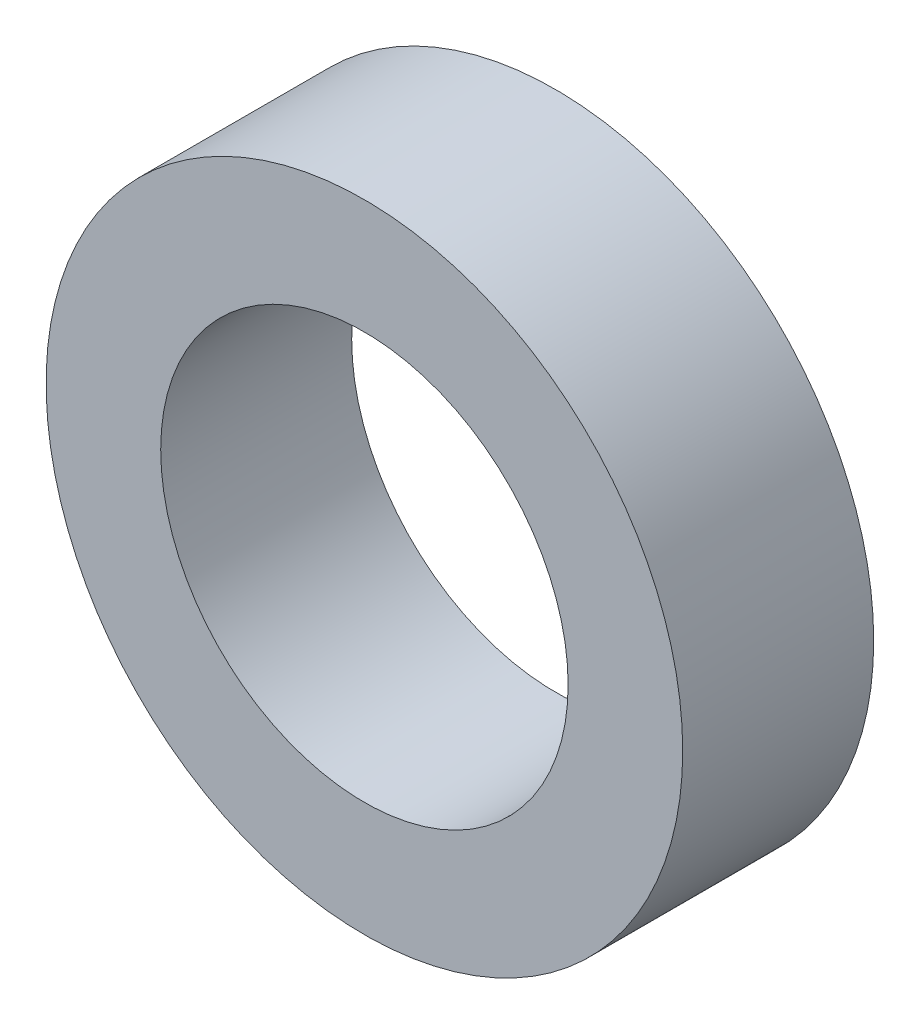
ISO-10303-21;
HEADER;
FILE_DESCRIPTION(('STEP AP214'),'2;1');
FILE_NAME('part.step','',(''),(''),'','','');
FILE_SCHEMA(('AUTOMOTIVE_DESIGN { 1 0 10303 214 1 1 1 1 }'));
ENDSEC;
DATA;
#1=APPLICATION_CONTEXT('core data for automotive mechanical design processes');
#2=APPLICATION_PROTOCOL_DEFINITION('international standard','automotive_design',2000,#1);
#3=PRODUCT_CONTEXT('',#1,'mechanical');
#4=PRODUCT('Part','Part','',(#3));
#5=PRODUCT_RELATED_PRODUCT_CATEGORY('part','',(#4));
#6=PRODUCT_DEFINITION_FORMATION('','',#4);
#7=PRODUCT_DEFINITION_CONTEXT('part definition',#1,'design');
#8=PRODUCT_DEFINITION('design','',#6,#7);
#9=PRODUCT_DEFINITION_SHAPE('','',#8);
#10=(LENGTH_UNIT() NAMED_UNIT(*) SI_UNIT(.MILLI.,.METRE.));
#11=(NAMED_UNIT(*) PLANE_ANGLE_UNIT() SI_UNIT($,.RADIAN.));
#12=(NAMED_UNIT(*) SI_UNIT($,.STERADIAN.) SOLID_ANGLE_UNIT());
#13=UNCERTAINTY_MEASURE_WITH_UNIT(LENGTH_MEASURE(1.E-05),#10,'distance_accuracy_value','');
#14=(GEOMETRIC_REPRESENTATION_CONTEXT(3) GLOBAL_UNCERTAINTY_ASSIGNED_CONTEXT((#13)) GLOBAL_UNIT_ASSIGNED_CONTEXT((#10,
#11,#12)) REPRESENTATION_CONTEXT('',''));
#15=CARTESIAN_POINT('',(0.,0.,0.));
#16=DIRECTION('',(0.,0.,1.));
#17=DIRECTION('',(1.,0.,0.));
#18=AXIS2_PLACEMENT_3D('',#15,#16,#17);
#19=CARTESIAN_POINT('',(0.,0.,3.));
#20=DIRECTION('',(0.,0.,1.));
#21=DIRECTION('',(1.,0.,0.));
#22=AXIS2_PLACEMENT_3D('',#19,#20,#21);
#23=PLANE('',#22);
#24=CARTESIAN_POINT('',(0.,0.,3.));
#25=DIRECTION('',(0.,0.,1.));
#26=DIRECTION('',(1.,0.,0.));
#27=AXIS2_PLACEMENT_3D('',#24,#25,#26);
#28=CIRCLE('',#27,5.);
#29=CARTESIAN_POINT('',(5.,0.,3.));
#30=VERTEX_POINT('',#29);
#31=EDGE_CURVE('E8',#30,#30,#28,.T.);
#32=ORIENTED_EDGE('',*,*,#31,.T.);
#33=EDGE_LOOP('',(#32));
#34=FACE_BOUND('',#33,.T.);
#35=CARTESIAN_POINT('',(0.,0.,3.));
#36=DIRECTION('',(0.,0.,1.));
#37=DIRECTION('',(1.,0.,0.));
#38=AXIS2_PLACEMENT_3D('',#35,#36,#37);
#39=CIRCLE('',#38,3.2);
#40=CARTESIAN_POINT('',(3.2,0.,3.));
#41=VERTEX_POINT('',#40);
#42=EDGE_CURVE('E23',#41,#41,#39,.T.);
#43=ORIENTED_EDGE('',*,*,#42,.F.);
#44=EDGE_LOOP('',(#43));
#45=FACE_BOUND('',#44,.T.);
#46=ADVANCED_FACE('F12',(#34,#45),#23,.T.);
#47=CARTESIAN_POINT('',(0.,0.,0.));
#48=DIRECTION('',(0.,0.,1.));
#49=DIRECTION('',(1.,0.,0.));
#50=AXIS2_PLACEMENT_3D('',#47,#48,#49);
#51=PLANE('',#50);
#52=CARTESIAN_POINT('',(0.,0.,0.));
#53=DIRECTION('',(0.,0.,1.));
#54=DIRECTION('',(1.,0.,0.));
#55=AXIS2_PLACEMENT_3D('',#52,#53,#54);
#56=CIRCLE('',#55,5.);
#57=CARTESIAN_POINT('',(5.,0.,0.));
#58=VERTEX_POINT('',#57);
#59=EDGE_CURVE('E19',#58,#58,#56,.T.);
#60=ORIENTED_EDGE('',*,*,#59,.F.);
#61=EDGE_LOOP('',(#60));
#62=FACE_BOUND('',#61,.T.);
#63=CARTESIAN_POINT('',(0.,0.,0.));
#64=DIRECTION('',(0.,0.,1.));
#65=DIRECTION('',(1.,0.,0.));
#66=AXIS2_PLACEMENT_3D('',#63,#64,#65);
#67=CIRCLE('',#66,3.2);
#68=CARTESIAN_POINT('',(3.2,0.,0.));
#69=VERTEX_POINT('',#68);
#70=EDGE_CURVE('E27',#69,#69,#67,.T.);
#71=ORIENTED_EDGE('',*,*,#70,.T.);
#72=EDGE_LOOP('',(#71));
#73=FACE_BOUND('',#72,.T.);
#74=ADVANCED_FACE('F33',(#62,#73),#51,.F.);
#75=CARTESIAN_POINT('',(0.,0.,3.));
#76=DIRECTION('',(0.,0.,-1.));
#77=DIRECTION('',(-1.,0.,0.));
#78=AXIS2_PLACEMENT_3D('',#75,#76,#77);
#79=CYLINDRICAL_SURFACE('',#78,5.);
#80=ORIENTED_EDGE('',*,*,#31,.F.);
#81=EDGE_LOOP('',(#80));
#82=FACE_BOUND('',#81,.T.);
#83=ORIENTED_EDGE('',*,*,#59,.T.);
#84=EDGE_LOOP('',(#83));
#85=FACE_BOUND('',#84,.T.);
#86=ADVANCED_FACE('F14',(#82,#85),#79,.T.);
#87=CARTESIAN_POINT('',(0.,0.,3.));
#88=DIRECTION('',(0.,0.,-1.));
#89=DIRECTION('',(-1.,0.,0.));
#90=AXIS2_PLACEMENT_3D('',#87,#88,#89);
#91=CYLINDRICAL_SURFACE('',#90,3.2);
#92=ORIENTED_EDGE('',*,*,#42,.T.);
#93=EDGE_LOOP('',(#92));
#94=FACE_BOUND('',#93,.T.);
#95=ORIENTED_EDGE('',*,*,#70,.F.);
#96=EDGE_LOOP('',(#95));
#97=FACE_BOUND('',#96,.T.);
#98=ADVANCED_FACE('F35',(#94,#97),#91,.F.);
#99=CLOSED_SHELL('',(#46,#74,#86,#98));
#100=MANIFOLD_SOLID_BREP('B1',#99);
#101=ADVANCED_BREP_SHAPE_REPRESENTATION('',(#18,#100),#14);
#102=SHAPE_DEFINITION_REPRESENTATION(#9,#101);
ENDSEC;
END-ISO-10303-21;
